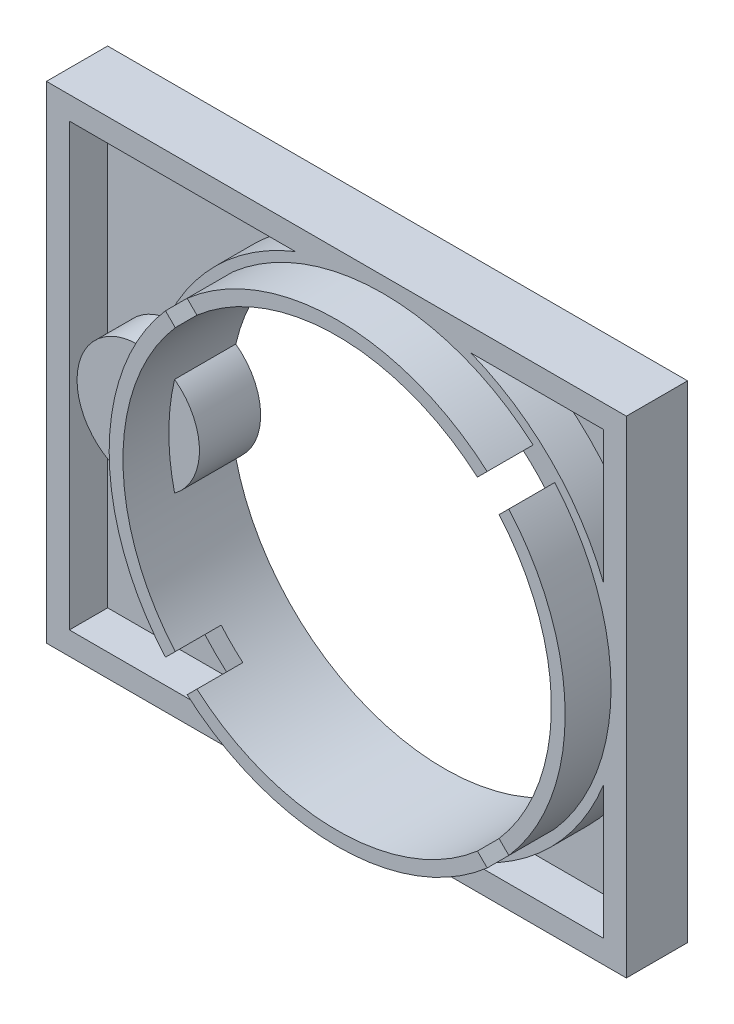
ISO-10303-21;
HEADER;
FILE_DESCRIPTION(('STEP AP214'),'2;1');
FILE_NAME('part.step','',(''),(''),'','','');
FILE_SCHEMA(('AUTOMOTIVE_DESIGN { 1 0 10303 214 1 1 1 1 }'));
ENDSEC;
DATA;
#1=APPLICATION_CONTEXT('core data for automotive mechanical design processes');
#2=APPLICATION_PROTOCOL_DEFINITION('international standard','automotive_design',2000,#1);
#3=PRODUCT_CONTEXT('',#1,'mechanical');
#4=PRODUCT('Part','Part','',(#3));
#5=PRODUCT_RELATED_PRODUCT_CATEGORY('part','',(#4));
#6=PRODUCT_DEFINITION_FORMATION('','',#4);
#7=PRODUCT_DEFINITION_CONTEXT('part definition',#1,'design');
#8=PRODUCT_DEFINITION('design','',#6,#7);
#9=PRODUCT_DEFINITION_SHAPE('','',#8);
#10=(LENGTH_UNIT() NAMED_UNIT(*) SI_UNIT(.MILLI.,.METRE.));
#11=(NAMED_UNIT(*) PLANE_ANGLE_UNIT() SI_UNIT($,.RADIAN.));
#12=(NAMED_UNIT(*) SI_UNIT($,.STERADIAN.) SOLID_ANGLE_UNIT());
#13=UNCERTAINTY_MEASURE_WITH_UNIT(LENGTH_MEASURE(1.E-05),#10,'distance_accuracy_value','');
#14=(GEOMETRIC_REPRESENTATION_CONTEXT(3) GLOBAL_UNCERTAINTY_ASSIGNED_CONTEXT((#13)) GLOBAL_UNIT_ASSIGNED_CONTEXT((#10,
#11,#12)) REPRESENTATION_CONTEXT('',''));
#15=CARTESIAN_POINT('',(0.,0.,0.));
#16=DIRECTION('',(0.,0.,1.));
#17=DIRECTION('',(1.,0.,0.));
#18=AXIS2_PLACEMENT_3D('',#15,#16,#17);
#19=CARTESIAN_POINT('',(0.,0.,3.));
#20=DIRECTION('',(0.,0.,-1.));
#21=DIRECTION('',(-1.,0.,0.));
#22=AXIS2_PLACEMENT_3D('',#19,#20,#21);
#23=CYLINDRICAL_SURFACE('',#22,14.9);
#24=CARTESIAN_POINT('',(0.,0.,0.));
#25=DIRECTION('',(0.,0.,1.));
#26=DIRECTION('',(1.,0.,0.));
#27=AXIS2_PLACEMENT_3D('',#24,#25,#26);
#28=CIRCLE('',#27,14.9);
#29=CARTESIAN_POINT('',(11.2192426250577,-9.80502906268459,0.));
#30=VERTEX_POINT('',#29);
#31=CARTESIAN_POINT('',(11.2192426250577,9.80502906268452,0.));
#32=VERTEX_POINT('',#31);
#33=EDGE_CURVE('E269',#30,#32,#28,.T.);
#34=ORIENTED_EDGE('',*,*,#33,.T.);
#35=DIRECTION('',(0.,0.,-1.));
#36=VECTOR('',#35,1.);
#37=CARTESIAN_POINT('',(11.2192426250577,9.80502906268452,3.));
#38=LINE('',#37,#36);
#39=CARTESIAN_POINT('',(11.2192426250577,9.80502906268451,3.));
#40=VERTEX_POINT('',#39);
#41=EDGE_CURVE('E254',#32,#40,#38,.F.);
#42=ORIENTED_EDGE('',*,*,#41,.T.);
#43=CARTESIAN_POINT('',(0.,0.,3.));
#44=DIRECTION('',(0.,0.,1.));
#45=DIRECTION('',(1.,0.,0.));
#46=AXIS2_PLACEMENT_3D('',#43,#44,#45);
#47=CIRCLE('',#46,14.9);
#48=CARTESIAN_POINT('',(11.2192426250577,-9.80502906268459,3.));
#49=VERTEX_POINT('',#48);
#50=EDGE_CURVE('E694',#49,#40,#47,.T.);
#51=ORIENTED_EDGE('',*,*,#50,.F.);
#52=DIRECTION('',(0.,0.,-1.));
#53=VECTOR('',#52,1.);
#54=CARTESIAN_POINT('',(11.2192426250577,-9.80502906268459,3.));
#55=LINE('',#54,#53);
#56=EDGE_CURVE('E274',#49,#30,#55,.T.);
#57=ORIENTED_EDGE('',*,*,#56,.T.);
#58=EDGE_LOOP('',(#34,#42,#51,#57));
#59=FACE_BOUND('',#58,.T.);
#60=ADVANCED_FACE('F34',(#59),#23,.T.);
#61=CARTESIAN_POINT('',(-9.80502906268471,-11.2192426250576,0.));
#62=VERTEX_POINT('',#61);
#63=CARTESIAN_POINT('',(9.80502906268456,-11.2192426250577,0.));
#64=VERTEX_POINT('',#63);
#65=EDGE_CURVE('E275',#62,#64,#28,.T.);
#66=ORIENTED_EDGE('',*,*,#65,.T.);
#67=DIRECTION('',(0.,0.,-1.));
#68=VECTOR('',#67,1.);
#69=CARTESIAN_POINT('',(9.80502906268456,-11.2192426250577,3.));
#70=LINE('',#69,#68);
#71=CARTESIAN_POINT('',(9.80502906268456,-11.2192426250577,3.));
#72=VERTEX_POINT('',#71);
#73=EDGE_CURVE('E383',#64,#72,#70,.F.);
#74=ORIENTED_EDGE('',*,*,#73,.T.);
#75=CARTESIAN_POINT('',(-9.80502906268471,-11.2192426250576,3.));
#76=VERTEX_POINT('',#75);
#77=EDGE_CURVE('E352',#76,#72,#47,.T.);
#78=ORIENTED_EDGE('',*,*,#77,.F.);
#79=DIRECTION('',(0.,0.,-1.));
#80=VECTOR('',#79,1.);
#81=CARTESIAN_POINT('',(-9.80502906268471,-11.2192426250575,3.));
#82=LINE('',#81,#80);
#83=EDGE_CURVE('E376',#76,#62,#82,.T.);
#84=ORIENTED_EDGE('',*,*,#83,.T.);
#85=EDGE_LOOP('',(#66,#74,#78,#84));
#86=FACE_BOUND('',#85,.T.);
#87=ADVANCED_FACE('F555',(#86),#23,.T.);
#88=CARTESIAN_POINT('',(-11.2192426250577,9.80502906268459,0.));
#89=VERTEX_POINT('',#88);
#90=CARTESIAN_POINT('',(-11.2192426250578,-9.80502906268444,0.));
#91=VERTEX_POINT('',#90);
#92=EDGE_CURVE('E279',#89,#91,#28,.T.);
#93=ORIENTED_EDGE('',*,*,#92,.T.);
#94=DIRECTION('',(0.,0.,-1.));
#95=VECTOR('',#94,1.);
#96=CARTESIAN_POINT('',(-11.2192426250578,-9.80502906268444,3.));
#97=LINE('',#96,#95);
#98=CARTESIAN_POINT('',(-11.2192426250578,-9.80502906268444,3.));
#99=VERTEX_POINT('',#98);
#100=EDGE_CURVE('E379',#91,#99,#97,.F.);
#101=ORIENTED_EDGE('',*,*,#100,.T.);
#102=CARTESIAN_POINT('',(-11.2192426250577,9.80502906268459,3.));
#103=VERTEX_POINT('',#102);
#104=EDGE_CURVE('E285',#103,#99,#47,.T.);
#105=ORIENTED_EDGE('',*,*,#104,.F.);
#106=DIRECTION('',(0.,0.,-1.));
#107=VECTOR('',#106,1.);
#108=CARTESIAN_POINT('',(-11.2192426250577,9.80502906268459,3.));
#109=LINE('',#108,#107);
#110=EDGE_CURVE('E396',#103,#89,#109,.T.);
#111=ORIENTED_EDGE('',*,*,#110,.T.);
#112=EDGE_LOOP('',(#93,#101,#105,#111));
#113=FACE_BOUND('',#112,.T.);
#114=ADVANCED_FACE('F546',(#113),#23,.T.);
#115=CARTESIAN_POINT('',(0.,0.,3.));
#116=DIRECTION('',(0.,0.,1.));
#117=DIRECTION('',(1.,0.,0.));
#118=AXIS2_PLACEMENT_3D('',#115,#116,#117);
#119=PLANE('',#118);
#120=DIRECTION('',(0.707106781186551,0.707106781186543,0.));
#121=VECTOR('',#120,1.);
#122=CARTESIAN_POINT('',(9.19238815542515,7.77817459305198,3.));
#123=LINE('',#122,#121);
#124=CARTESIAN_POINT('',(10.5813156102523,9.16710204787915,3.));
#125=VERTEX_POINT('',#124);
#126=EDGE_CURVE('E259',#125,#40,#123,.T.);
#127=ORIENTED_EDGE('',*,*,#126,.F.);
#128=CARTESIAN_POINT('',(0.,0.,3.));
#129=DIRECTION('',(0.,0.,1.));
#130=DIRECTION('',(1.,0.,0.));
#131=AXIS2_PLACEMENT_3D('',#128,#129,#130);
#132=CIRCLE('',#131,14.);
#133=CARTESIAN_POINT('',(10.5813156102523,-9.16710204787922,3.));
#134=VERTEX_POINT('',#133);
#135=EDGE_CURVE('E328',#134,#125,#132,.T.);
#136=ORIENTED_EDGE('',*,*,#135,.F.);
#137=DIRECTION('',(-0.707106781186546,0.707106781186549,0.));
#138=VECTOR('',#137,1.);
#139=CARTESIAN_POINT('',(12.7279220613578,-11.3137084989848,3.));
#140=LINE('',#139,#138);
#141=EDGE_CURVE('E356',#49,#134,#140,.T.);
#142=ORIENTED_EDGE('',*,*,#141,.F.);
#143=ORIENTED_EDGE('',*,*,#50,.T.);
#144=EDGE_LOOP('',(#127,#136,#142,#143));
#145=FACE_BOUND('',#144,.T.);
#146=ADVANCED_FACE('F563',(#145),#119,.T.);
#147=DIRECTION('',(0.707106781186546,-0.707106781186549,0.));
#148=VECTOR('',#147,1.);
#149=CARTESIAN_POINT('',(7.77817459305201,-9.19238815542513,3.));
#150=LINE('',#149,#148);
#151=CARTESIAN_POINT('',(9.16710204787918,-10.5813156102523,3.));
#152=VERTEX_POINT('',#151);
#153=EDGE_CURVE('E351',#152,#72,#150,.T.);
#154=ORIENTED_EDGE('',*,*,#153,.F.);
#155=CARTESIAN_POINT('',(-9.16710204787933,-10.5813156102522,3.));
#156=VERTEX_POINT('',#155);
#157=EDGE_CURVE('E331',#156,#152,#132,.T.);
#158=ORIENTED_EDGE('',*,*,#157,.F.);
#159=DIRECTION('',(0.707106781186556,0.707106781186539,0.));
#160=VECTOR('',#159,1.);
#161=CARTESIAN_POINT('',(-11.3137084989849,-12.7279220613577,3.));
#162=LINE('',#161,#160);
#163=EDGE_CURVE('E349',#76,#156,#162,.T.);
#164=ORIENTED_EDGE('',*,*,#163,.F.);
#165=ORIENTED_EDGE('',*,*,#77,.T.);
#166=EDGE_LOOP('',(#154,#158,#164,#165));
#167=FACE_BOUND('',#166,.T.);
#168=ADVANCED_FACE('F347',(#167),#119,.T.);
#169=DIRECTION('',(-0.707106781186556,-0.707106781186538,0.));
#170=VECTOR('',#169,1.);
#171=CARTESIAN_POINT('',(-9.19238815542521,-7.77817459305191,3.));
#172=LINE('',#171,#170);
#173=CARTESIAN_POINT('',(-10.5813156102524,-9.16710204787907,3.));
#174=VERTEX_POINT('',#173);
#175=EDGE_CURVE('E367',#174,#99,#172,.T.);
#176=ORIENTED_EDGE('',*,*,#175,.F.);
#177=CARTESIAN_POINT('',(-10.5813156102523,9.16710204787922,3.));
#178=VERTEX_POINT('',#177);
#179=EDGE_CURVE('E330',#178,#174,#132,.T.);
#180=ORIENTED_EDGE('',*,*,#179,.F.);
#181=DIRECTION('',(0.707106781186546,-0.707106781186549,0.));
#182=VECTOR('',#181,1.);
#183=CARTESIAN_POINT('',(-12.7279220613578,11.3137084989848,3.));
#184=LINE('',#183,#182);
#185=EDGE_CURVE('E264',#103,#178,#184,.T.);
#186=ORIENTED_EDGE('',*,*,#185,.F.);
#187=ORIENTED_EDGE('',*,*,#104,.T.);
#188=EDGE_LOOP('',(#176,#180,#186,#187));
#189=FACE_BOUND('',#188,.T.);
#190=ADVANCED_FACE('F537',(#189),#119,.T.);
#191=CARTESIAN_POINT('',(0.,0.,0.));
#192=DIRECTION('',(0.,0.,1.));
#193=DIRECTION('',(1.,0.,0.));
#194=AXIS2_PLACEMENT_3D('',#191,#192,#193);
#195=PLANE('',#194);
#196=DIRECTION('',(0.,-1.,0.));
#197=VECTOR('',#196,1.);
#198=CARTESIAN_POINT('',(14.4,0.,0.));
#199=LINE('',#198,#197);
#200=CARTESIAN_POINT('',(14.4,14.4,0.));
#201=VERTEX_POINT('',#200);
#202=CARTESIAN_POINT('',(14.4,5.73498038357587,0.));
#203=VERTEX_POINT('',#202);
#204=EDGE_CURVE('E459',#201,#203,#199,.T.);
#205=ORIENTED_EDGE('',*,*,#204,.T.);
#206=CARTESIAN_POINT('',(0.,0.,0.));
#207=DIRECTION('',(0.,0.,1.));
#208=DIRECTION('',(1.,0.,0.));
#209=AXIS2_PLACEMENT_3D('',#206,#207,#208);
#210=CIRCLE('',#209,15.5);
#211=CARTESIAN_POINT('',(5.73498038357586,14.4,0.));
#212=VERTEX_POINT('',#211);
#213=EDGE_CURVE('E483',#212,#203,#210,.F.);
#214=ORIENTED_EDGE('',*,*,#213,.F.);
#215=DIRECTION('',(1.,0.,0.));
#216=VECTOR('',#215,1.);
#217=CARTESIAN_POINT('',(0.,14.4,0.));
#218=LINE('',#217,#216);
#219=EDGE_CURVE('E466',#212,#201,#218,.T.);
#220=ORIENTED_EDGE('',*,*,#219,.T.);
#221=EDGE_LOOP('',(#205,#214,#220));
#222=FACE_BOUND('',#221,.T.);
#223=DIRECTION('',(-1.,0.,0.));
#224=VECTOR('',#223,1.);
#225=CARTESIAN_POINT('',(0.,-14.4,0.));
#226=LINE('',#225,#224);
#227=CARTESIAN_POINT('',(14.4,-14.4,0.));
#228=VERTEX_POINT('',#227);
#229=CARTESIAN_POINT('',(5.73498038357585,-14.4,0.));
#230=VERTEX_POINT('',#229);
#231=EDGE_CURVE('E455',#228,#230,#226,.T.);
#232=ORIENTED_EDGE('',*,*,#231,.T.);
#233=CARTESIAN_POINT('',(14.4,-5.73498038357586,0.));
#234=VERTEX_POINT('',#233);
#235=EDGE_CURVE('E488',#234,#230,#210,.F.);
#236=ORIENTED_EDGE('',*,*,#235,.F.);
#237=EDGE_CURVE('E462',#234,#228,#199,.T.);
#238=ORIENTED_EDGE('',*,*,#237,.T.);
#239=EDGE_LOOP('',(#232,#236,#238));
#240=FACE_BOUND('',#239,.T.);
#241=CARTESIAN_POINT('',(-16.,0.,0.));
#242=DIRECTION('',(0.,0.,1.));
#243=DIRECTION('',(1.,0.,0.));
#244=AXIS2_PLACEMENT_3D('',#241,#242,#243);
#245=CIRCLE('',#244,4.);
#246=CARTESIAN_POINT('',(-15.0078125,-3.87499212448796,0.));
#247=VERTEX_POINT('',#246);
#248=CARTESIAN_POINT('',(-15.0078125,3.87499212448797,0.));
#249=VERTEX_POINT('',#248);
#250=EDGE_CURVE('E407',#247,#249,#245,.F.);
#251=ORIENTED_EDGE('',*,*,#250,.F.);
#252=CARTESIAN_POINT('',(-5.73498038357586,-14.4,0.));
#253=VERTEX_POINT('',#252);
#254=EDGE_CURVE('E486',#253,#247,#210,.F.);
#255=ORIENTED_EDGE('',*,*,#254,.F.);
#256=CARTESIAN_POINT('',(-20.5,-14.4,0.));
#257=VERTEX_POINT('',#256);
#258=EDGE_CURVE('E427',#253,#257,#226,.T.);
#259=ORIENTED_EDGE('',*,*,#258,.T.);
#260=DIRECTION('',(0.,1.,0.));
#261=VECTOR('',#260,1.);
#262=CARTESIAN_POINT('',(-20.5,0.,0.));
#263=LINE('',#262,#261);
#264=CARTESIAN_POINT('',(-20.5,14.4,0.));
#265=VERTEX_POINT('',#264);
#266=EDGE_CURVE('E458',#257,#265,#263,.T.);
#267=ORIENTED_EDGE('',*,*,#266,.T.);
#268=CARTESIAN_POINT('',(-5.73498038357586,14.4,0.));
#269=VERTEX_POINT('',#268);
#270=EDGE_CURVE('E463',#265,#269,#218,.T.);
#271=ORIENTED_EDGE('',*,*,#270,.T.);
#272=EDGE_CURVE('E485',#249,#269,#210,.F.);
#273=ORIENTED_EDGE('',*,*,#272,.F.);
#274=EDGE_LOOP('',(#251,#255,#259,#267,#271,#273));
#275=FACE_BOUND('',#274,.T.);
#276=DIRECTION('',(-0.707106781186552,-0.707106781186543,0.));
#277=VECTOR('',#276,1.);
#278=CARTESIAN_POINT('',(9.19238815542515,7.77817459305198,0.));
#279=LINE('',#278,#277);
#280=CARTESIAN_POINT('',(10.5813156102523,9.16710204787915,0.));
#281=VERTEX_POINT('',#280);
#282=EDGE_CURVE('E257',#32,#281,#279,.T.);
#283=ORIENTED_EDGE('',*,*,#282,.F.);
#284=ORIENTED_EDGE('',*,*,#33,.F.);
#285=DIRECTION('',(0.707106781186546,-0.707106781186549,0.));
#286=VECTOR('',#285,1.);
#287=CARTESIAN_POINT('',(12.7279220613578,-11.3137084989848,0.));
#288=LINE('',#287,#286);
#289=CARTESIAN_POINT('',(10.5813156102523,-9.16710204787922,0.));
#290=VERTEX_POINT('',#289);
#291=EDGE_CURVE('E56',#290,#30,#288,.T.);
#292=ORIENTED_EDGE('',*,*,#291,.F.);
#293=CARTESIAN_POINT('',(0.,0.,0.));
#294=DIRECTION('',(0.,0.,1.));
#295=DIRECTION('',(1.,0.,0.));
#296=AXIS2_PLACEMENT_3D('',#293,#294,#295);
#297=CIRCLE('',#296,14.);
#298=CARTESIAN_POINT('',(9.16710204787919,-10.5813156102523,0.));
#299=VERTEX_POINT('',#298);
#300=EDGE_CURVE('E372',#290,#299,#297,.F.);
#301=ORIENTED_EDGE('',*,*,#300,.T.);
#302=DIRECTION('',(-0.707106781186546,0.707106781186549,0.));
#303=VECTOR('',#302,1.);
#304=CARTESIAN_POINT('',(7.77817459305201,-9.19238815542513,0.));
#305=LINE('',#304,#303);
#306=EDGE_CURVE('E355',#64,#299,#305,.T.);
#307=ORIENTED_EDGE('',*,*,#306,.F.);
#308=ORIENTED_EDGE('',*,*,#65,.F.);
#309=DIRECTION('',(-0.707106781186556,-0.707106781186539,0.));
#310=VECTOR('',#309,1.);
#311=CARTESIAN_POINT('',(-11.3137084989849,-12.7279220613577,0.));
#312=LINE('',#311,#310);
#313=CARTESIAN_POINT('',(-9.16710204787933,-10.5813156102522,0.));
#314=VERTEX_POINT('',#313);
#315=EDGE_CURVE('E360',#314,#62,#312,.T.);
#316=ORIENTED_EDGE('',*,*,#315,.F.);
#317=CARTESIAN_POINT('',(0.,0.,0.));
#318=DIRECTION('',(0.,0.,1.));
#319=DIRECTION('',(1.,0.,0.));
#320=AXIS2_PLACEMENT_3D('',#317,#318,#319);
#321=CIRCLE('',#320,14.);
#322=CARTESIAN_POINT('',(-10.5813156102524,-9.16710204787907,0.));
#323=VERTEX_POINT('',#322);
#324=EDGE_CURVE('E374',#314,#323,#321,.F.);
#325=ORIENTED_EDGE('',*,*,#324,.T.);
#326=DIRECTION('',(0.707106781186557,0.707106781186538,0.));
#327=VECTOR('',#326,1.);
#328=CARTESIAN_POINT('',(-9.19238815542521,-7.77817459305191,0.));
#329=LINE('',#328,#327);
#330=EDGE_CURVE('E364',#91,#323,#329,.T.);
#331=ORIENTED_EDGE('',*,*,#330,.F.);
#332=ORIENTED_EDGE('',*,*,#92,.F.);
#333=DIRECTION('',(-0.707106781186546,0.707106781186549,0.));
#334=VECTOR('',#333,1.);
#335=CARTESIAN_POINT('',(-12.7279220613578,11.3137084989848,0.));
#336=LINE('',#335,#334);
#337=CARTESIAN_POINT('',(-10.5813156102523,9.16710204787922,0.));
#338=VERTEX_POINT('',#337);
#339=EDGE_CURVE('E390',#338,#89,#336,.T.);
#340=ORIENTED_EDGE('',*,*,#339,.F.);
#341=CARTESIAN_POINT('',(0.,0.,0.));
#342=DIRECTION('',(0.,0.,1.));
#343=DIRECTION('',(1.,0.,0.));
#344=AXIS2_PLACEMENT_3D('',#341,#342,#343);
#345=CIRCLE('',#344,14.);
#346=CARTESIAN_POINT('',(-9.16710204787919,10.5813156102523,0.));
#347=VERTEX_POINT('',#346);
#348=EDGE_CURVE('E394',#338,#347,#345,.F.);
#349=ORIENTED_EDGE('',*,*,#348,.T.);
#350=DIRECTION('',(0.707106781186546,-0.707106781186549,0.));
#351=VECTOR('',#350,1.);
#352=CARTESIAN_POINT('',(-7.77817459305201,9.19238815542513,0.));
#353=LINE('',#352,#351);
#354=CARTESIAN_POINT('',(-9.80502906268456,11.2192426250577,0.));
#355=VERTEX_POINT('',#354);
#356=EDGE_CURVE('E387',#355,#347,#353,.T.);
#357=ORIENTED_EDGE('',*,*,#356,.F.);
#358=CARTESIAN_POINT('',(9.80502906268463,11.2192426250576,0.));
#359=VERTEX_POINT('',#358);
#360=EDGE_CURVE('E276',#359,#355,#28,.T.);
#361=ORIENTED_EDGE('',*,*,#360,.F.);
#362=DIRECTION('',(0.707106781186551,0.707106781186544,0.));
#363=VECTOR('',#362,1.);
#364=CARTESIAN_POINT('',(11.3137084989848,12.7279220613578,0.));
#365=LINE('',#364,#363);
#366=CARTESIAN_POINT('',(9.16710204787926,10.5813156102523,0.));
#367=VERTEX_POINT('',#366);
#368=EDGE_CURVE('E49',#367,#359,#365,.T.);
#369=ORIENTED_EDGE('',*,*,#368,.F.);
#370=CARTESIAN_POINT('',(0.,0.,0.));
#371=DIRECTION('',(0.,0.,1.));
#372=DIRECTION('',(1.,0.,0.));
#373=AXIS2_PLACEMENT_3D('',#370,#371,#372);
#374=CIRCLE('',#373,14.);
#375=EDGE_CURVE('E271',#367,#281,#374,.F.);
#376=ORIENTED_EDGE('',*,*,#375,.T.);
#377=EDGE_LOOP('',(#283,#284,#292,#301,#307,#308,#316,#325,#331,#332,#340,#349,#357,#361,#369,#376));
#378=FACE_BOUND('',#377,.T.);
#379=DIRECTION('',(-1.,0.,0.));
#380=VECTOR('',#379,1.);
#381=CARTESIAN_POINT('',(-22.,-15.9,0.));
#382=LINE('',#381,#380);
#383=CARTESIAN_POINT('',(15.9,-15.9,0.));
#384=VERTEX_POINT('',#383);
#385=CARTESIAN_POINT('',(-22.,-15.9,0.));
#386=VERTEX_POINT('',#385);
#387=EDGE_CURVE('E338',#384,#386,#382,.T.);
#388=ORIENTED_EDGE('',*,*,#387,.F.);
#389=DIRECTION('',(0.,-1.,0.));
#390=VECTOR('',#389,1.);
#391=CARTESIAN_POINT('',(15.9,-15.9,0.));
#392=LINE('',#391,#390);
#393=CARTESIAN_POINT('',(15.9,15.9,0.));
#394=VERTEX_POINT('',#393);
#395=EDGE_CURVE('E645',#394,#384,#392,.T.);
#396=ORIENTED_EDGE('',*,*,#395,.F.);
#397=DIRECTION('',(1.,0.,0.));
#398=VECTOR('',#397,1.);
#399=CARTESIAN_POINT('',(15.9,15.9,0.));
#400=LINE('',#399,#398);
#401=CARTESIAN_POINT('',(-22.,15.9,0.));
#402=VERTEX_POINT('',#401);
#403=EDGE_CURVE('E661',#402,#394,#400,.T.);
#404=ORIENTED_EDGE('',*,*,#403,.F.);
#405=DIRECTION('',(0.,1.,0.));
#406=VECTOR('',#405,1.);
#407=CARTESIAN_POINT('',(-22.,15.9,0.));
#408=LINE('',#407,#406);
#409=EDGE_CURVE('E663',#386,#402,#408,.T.);
#410=ORIENTED_EDGE('',*,*,#409,.F.);
#411=EDGE_LOOP('',(#388,#396,#404,#410));
#412=FACE_BOUND('',#411,.T.);
#413=CARTESIAN_POINT('',(-16.,0.,0.));
#414=DIRECTION('',(0.,0.,1.));
#415=DIRECTION('',(1.,0.,0.));
#416=AXIS2_PLACEMENT_3D('',#413,#414,#415);
#417=CIRCLE('',#416,0.750000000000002);
#418=CARTESIAN_POINT('',(-15.25,0.,0.));
#419=VERTEX_POINT('',#418);
#420=EDGE_CURVE('E287',#419,#419,#417,.T.);
#421=ORIENTED_EDGE('',*,*,#420,.F.);
#422=EDGE_LOOP('',(#421));
#423=FACE_BOUND('',#422,.T.);
#424=ADVANCED_FACE('F267',(#222,#240,#275,#378,#412,#423),#195,.T.);
#425=CARTESIAN_POINT('',(9.80502906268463,11.2192426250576,3.));
#426=VERTEX_POINT('',#425);
#427=CARTESIAN_POINT('',(-9.80502906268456,11.2192426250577,3.));
#428=VERTEX_POINT('',#427);
#429=EDGE_CURVE('E284',#426,#428,#47,.T.);
#430=ORIENTED_EDGE('',*,*,#429,.F.);
#431=DIRECTION('',(0.,0.,-1.));
#432=VECTOR('',#431,1.);
#433=CARTESIAN_POINT('',(9.80502906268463,11.2192426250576,3.));
#434=LINE('',#433,#432);
#435=EDGE_CURVE('E265',#426,#359,#434,.T.);
#436=ORIENTED_EDGE('',*,*,#435,.T.);
#437=ORIENTED_EDGE('',*,*,#360,.T.);
#438=DIRECTION('',(0.,0.,-1.));
#439=VECTOR('',#438,1.);
#440=CARTESIAN_POINT('',(-9.80502906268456,11.2192426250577,3.));
#441=LINE('',#440,#439);
#442=EDGE_CURVE('E399',#355,#428,#441,.F.);
#443=ORIENTED_EDGE('',*,*,#442,.T.);
#444=EDGE_LOOP('',(#430,#436,#437,#443));
#445=FACE_BOUND('',#444,.T.);
#446=ADVANCED_FACE('F36',(#445),#23,.T.);
#447=DIRECTION('',(-0.707106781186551,-0.707106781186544,0.));
#448=VECTOR('',#447,1.);
#449=CARTESIAN_POINT('',(11.3137084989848,12.7279220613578,3.));
#450=LINE('',#449,#448);
#451=CARTESIAN_POINT('',(9.16710204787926,10.5813156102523,3.));
#452=VERTEX_POINT('',#451);
#453=EDGE_CURVE('E324',#426,#452,#450,.T.);
#454=ORIENTED_EDGE('',*,*,#453,.F.);
#455=ORIENTED_EDGE('',*,*,#429,.T.);
#456=DIRECTION('',(-0.707106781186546,0.707106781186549,0.));
#457=VECTOR('',#456,1.);
#458=CARTESIAN_POINT('',(-7.77817459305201,9.19238815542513,3.));
#459=LINE('',#458,#457);
#460=CARTESIAN_POINT('',(-9.16710204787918,10.5813156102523,3.));
#461=VERTEX_POINT('',#460);
#462=EDGE_CURVE('E327',#461,#428,#459,.T.);
#463=ORIENTED_EDGE('',*,*,#462,.F.);
#464=EDGE_CURVE('E290',#452,#461,#132,.T.);
#465=ORIENTED_EDGE('',*,*,#464,.F.);
#466=EDGE_LOOP('',(#454,#455,#463,#465));
#467=FACE_BOUND('',#466,.T.);
#468=ADVANCED_FACE('F323',(#467),#119,.T.);
#469=CARTESIAN_POINT('',(-22.,-15.9,-4.));
#470=DIRECTION('',(0.,1.,0.));
#471=DIRECTION('',(-1.,0.,0.));
#472=AXIS2_PLACEMENT_3D('',#469,#470,#471);
#473=PLANE('',#472);
#474=ORIENTED_EDGE('',*,*,#387,.T.);
#475=DIRECTION('',(0.,0.,1.));
#476=VECTOR('',#475,1.);
#477=CARTESIAN_POINT('',(-22.,-15.9,-4.));
#478=LINE('',#477,#476);
#479=CARTESIAN_POINT('',(-22.,-15.9,-4.));
#480=VERTEX_POINT('',#479);
#481=EDGE_CURVE('E280',#480,#386,#478,.T.);
#482=ORIENTED_EDGE('',*,*,#481,.F.);
#483=DIRECTION('',(-1.,0.,0.));
#484=VECTOR('',#483,1.);
#485=CARTESIAN_POINT('',(-22.,-15.9,-4.));
#486=LINE('',#485,#484);
#487=CARTESIAN_POINT('',(15.9,-15.9,-4.));
#488=VERTEX_POINT('',#487);
#489=EDGE_CURVE('E636',#488,#480,#486,.T.);
#490=ORIENTED_EDGE('',*,*,#489,.F.);
#491=DIRECTION('',(0.,0.,1.));
#492=VECTOR('',#491,1.);
#493=CARTESIAN_POINT('',(15.9,-15.9,-4.));
#494=LINE('',#493,#492);
#495=EDGE_CURVE('E658',#488,#384,#494,.T.);
#496=ORIENTED_EDGE('',*,*,#495,.T.);
#497=EDGE_LOOP('',(#474,#482,#490,#496));
#498=FACE_BOUND('',#497,.T.);
#499=ADVANCED_FACE('F648',(#498),#473,.F.);
#500=CARTESIAN_POINT('',(-22.,15.9,-4.));
#501=DIRECTION('',(1.,0.,0.));
#502=DIRECTION('',(0.,1.,0.));
#503=AXIS2_PLACEMENT_3D('',#500,#501,#502);
#504=PLANE('',#503);
#505=ORIENTED_EDGE('',*,*,#409,.T.);
#506=DIRECTION('',(0.,0.,1.));
#507=VECTOR('',#506,1.);
#508=CARTESIAN_POINT('',(-22.,15.9,-4.));
#509=LINE('',#508,#507);
#510=CARTESIAN_POINT('',(-22.,15.9,-4.));
#511=VERTEX_POINT('',#510);
#512=EDGE_CURVE('E651',#511,#402,#509,.T.);
#513=ORIENTED_EDGE('',*,*,#512,.F.);
#514=DIRECTION('',(0.,1.,0.));
#515=VECTOR('',#514,1.);
#516=CARTESIAN_POINT('',(-22.,15.9,-4.));
#517=LINE('',#516,#515);
#518=EDGE_CURVE('E638',#480,#511,#517,.T.);
#519=ORIENTED_EDGE('',*,*,#518,.F.);
#520=ORIENTED_EDGE('',*,*,#481,.T.);
#521=EDGE_LOOP('',(#505,#513,#519,#520));
#522=FACE_BOUND('',#521,.T.);
#523=ADVANCED_FACE('F675',(#522),#504,.F.);
#524=CARTESIAN_POINT('',(15.9,15.9,-4.));
#525=DIRECTION('',(0.,-1.,0.));
#526=DIRECTION('',(0.,0.,-1.));
#527=AXIS2_PLACEMENT_3D('',#524,#525,#526);
#528=PLANE('',#527);
#529=ORIENTED_EDGE('',*,*,#403,.T.);
#530=DIRECTION('',(0.,0.,1.));
#531=VECTOR('',#530,1.);
#532=CARTESIAN_POINT('',(15.9,15.9,-4.));
#533=LINE('',#532,#531);
#534=CARTESIAN_POINT('',(15.9,15.9,-4.));
#535=VERTEX_POINT('',#534);
#536=EDGE_CURVE('E653',#535,#394,#533,.T.);
#537=ORIENTED_EDGE('',*,*,#536,.F.);
#538=DIRECTION('',(1.,0.,0.));
#539=VECTOR('',#538,1.);
#540=CARTESIAN_POINT('',(15.9,15.9,-4.));
#541=LINE('',#540,#539);
#542=EDGE_CURVE('E667',#511,#535,#541,.T.);
#543=ORIENTED_EDGE('',*,*,#542,.F.);
#544=ORIENTED_EDGE('',*,*,#512,.T.);
#545=EDGE_LOOP('',(#529,#537,#543,#544));
#546=FACE_BOUND('',#545,.T.);
#547=ADVANCED_FACE('F629',(#546),#528,.F.);
#548=CARTESIAN_POINT('',(15.9,-15.9,-4.));
#549=DIRECTION('',(-1.,0.,0.));
#550=DIRECTION('',(0.,-1.,0.));
#551=AXIS2_PLACEMENT_3D('',#548,#549,#550);
#552=PLANE('',#551);
#553=ORIENTED_EDGE('',*,*,#395,.T.);
#554=ORIENTED_EDGE('',*,*,#495,.F.);
#555=DIRECTION('',(0.,-1.,0.));
#556=VECTOR('',#555,1.);
#557=CARTESIAN_POINT('',(15.9,-15.9,-4.));
#558=LINE('',#557,#556);
#559=EDGE_CURVE('E641',#535,#488,#558,.T.);
#560=ORIENTED_EDGE('',*,*,#559,.F.);
#561=ORIENTED_EDGE('',*,*,#536,.T.);
#562=EDGE_LOOP('',(#553,#554,#560,#561));
#563=FACE_BOUND('',#562,.T.);
#564=ADVANCED_FACE('F624',(#563),#552,.F.);
#565=CARTESIAN_POINT('',(0.,0.,-4.));
#566=DIRECTION('',(0.,0.,1.));
#567=DIRECTION('',(1.,0.,0.));
#568=AXIS2_PLACEMENT_3D('',#565,#566,#567);
#569=PLANE('',#568);
#570=CARTESIAN_POINT('',(0.,0.,-4.));
#571=DIRECTION('',(0.,0.,1.));
#572=DIRECTION('',(1.,0.,0.));
#573=AXIS2_PLACEMENT_3D('',#570,#571,#572);
#574=CIRCLE('',#573,14.);
#575=CARTESIAN_POINT('',(-13.625,-3.21859829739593,-4.));
#576=VERTEX_POINT('',#575);
#577=CARTESIAN_POINT('',(-13.625,3.21859829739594,-4.));
#578=VERTEX_POINT('',#577);
#579=EDGE_CURVE('E335',#576,#578,#574,.T.);
#580=ORIENTED_EDGE('',*,*,#579,.T.);
#581=CARTESIAN_POINT('',(-16.,0.,-4.));
#582=DIRECTION('',(0.,0.,-1.));
#583=DIRECTION('',(-1.,0.,0.));
#584=AXIS2_PLACEMENT_3D('',#581,#582,#583);
#585=CIRCLE('',#584,4.);
#586=EDGE_CURVE('E403',#578,#576,#585,.T.);
#587=ORIENTED_EDGE('',*,*,#586,.T.);
#588=EDGE_LOOP('',(#580,#587));
#589=FACE_BOUND('',#588,.T.);
#590=ORIENTED_EDGE('',*,*,#489,.T.);
#591=ORIENTED_EDGE('',*,*,#518,.T.);
#592=ORIENTED_EDGE('',*,*,#542,.T.);
#593=ORIENTED_EDGE('',*,*,#559,.T.);
#594=EDGE_LOOP('',(#590,#591,#592,#593));
#595=FACE_BOUND('',#594,.T.);
#596=CARTESIAN_POINT('',(-16.,0.,-4.));
#597=DIRECTION('',(0.,0.,-1.));
#598=DIRECTION('',(-1.,0.,0.));
#599=AXIS2_PLACEMENT_3D('',#596,#597,#598);
#600=CIRCLE('',#599,0.750000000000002);
#601=CARTESIAN_POINT('',(-16.75,0.,-4.));
#602=VERTEX_POINT('',#601);
#603=EDGE_CURVE('E291',#602,#602,#600,.T.);
#604=ORIENTED_EDGE('',*,*,#603,.F.);
#605=EDGE_LOOP('',(#604));
#606=FACE_BOUND('',#605,.T.);
#607=ADVANCED_FACE('F622',(#589,#595,#606),#569,.F.);
#608=CARTESIAN_POINT('',(0.,0.,-4.));
#609=DIRECTION('',(0.,0.,1.));
#610=DIRECTION('',(1.,0.,0.));
#611=AXIS2_PLACEMENT_3D('',#608,#609,#610);
#612=CYLINDRICAL_SURFACE('',#611,14.);
#613=ORIENTED_EDGE('',*,*,#135,.T.);
#614=DIRECTION('',(0.,0.,1.));
#615=VECTOR('',#614,1.);
#616=CARTESIAN_POINT('',(10.5813156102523,9.16710204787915,-4.));
#617=LINE('',#616,#615);
#618=EDGE_CURVE('E11',#125,#281,#617,.F.);
#619=ORIENTED_EDGE('',*,*,#618,.T.);
#620=ORIENTED_EDGE('',*,*,#375,.F.);
#621=DIRECTION('',(0.,0.,1.));
#622=VECTOR('',#621,1.);
#623=CARTESIAN_POINT('',(9.16710204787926,10.5813156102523,-4.));
#624=LINE('',#623,#622);
#625=EDGE_CURVE('E42',#367,#452,#624,.T.);
#626=ORIENTED_EDGE('',*,*,#625,.T.);
#627=ORIENTED_EDGE('',*,*,#464,.T.);
#628=DIRECTION('',(0.,0.,1.));
#629=VECTOR('',#628,1.);
#630=CARTESIAN_POINT('',(-9.16710204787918,10.5813156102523,-4.));
#631=LINE('',#630,#629);
#632=EDGE_CURVE('E298',#461,#347,#631,.F.);
#633=ORIENTED_EDGE('',*,*,#632,.T.);
#634=ORIENTED_EDGE('',*,*,#348,.F.);
#635=DIRECTION('',(0.,0.,1.));
#636=VECTOR('',#635,1.);
#637=CARTESIAN_POINT('',(-10.5813156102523,9.16710204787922,-4.));
#638=LINE('',#637,#636);
#639=EDGE_CURVE('E295',#338,#178,#638,.T.);
#640=ORIENTED_EDGE('',*,*,#639,.T.);
#641=ORIENTED_EDGE('',*,*,#179,.T.);
#642=DIRECTION('',(0.,0.,1.));
#643=VECTOR('',#642,1.);
#644=CARTESIAN_POINT('',(-10.5813156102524,-9.16710204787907,-4.));
#645=LINE('',#644,#643);
#646=EDGE_CURVE('E304',#174,#323,#645,.F.);
#647=ORIENTED_EDGE('',*,*,#646,.T.);
#648=ORIENTED_EDGE('',*,*,#324,.F.);
#649=DIRECTION('',(0.,0.,1.));
#650=VECTOR('',#649,1.);
#651=CARTESIAN_POINT('',(-9.16710204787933,-10.5813156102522,-4.));
#652=LINE('',#651,#650);
#653=EDGE_CURVE('E301',#314,#156,#652,.T.);
#654=ORIENTED_EDGE('',*,*,#653,.T.);
#655=ORIENTED_EDGE('',*,*,#157,.T.);
#656=DIRECTION('',(0.,0.,1.));
#657=VECTOR('',#656,1.);
#658=CARTESIAN_POINT('',(9.16710204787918,-10.5813156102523,-4.));
#659=LINE('',#658,#657);
#660=EDGE_CURVE('E310',#152,#299,#659,.F.);
#661=ORIENTED_EDGE('',*,*,#660,.T.);
#662=ORIENTED_EDGE('',*,*,#300,.F.);
#663=DIRECTION('',(0.,0.,1.));
#664=VECTOR('',#663,1.);
#665=CARTESIAN_POINT('',(10.5813156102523,-9.16710204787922,-4.));
#666=LINE('',#665,#664);
#667=EDGE_CURVE('E307',#290,#134,#666,.T.);
#668=ORIENTED_EDGE('',*,*,#667,.T.);
#669=EDGE_LOOP('',(#613,#619,#620,#626,#627,#633,#634,#640,#641,#647,#648,#654,#655,#661,#662,#668));
#670=FACE_BOUND('',#669,.T.);
#671=ORIENTED_EDGE('',*,*,#579,.F.);
#672=DIRECTION('',(0.,0.,-1.));
#673=VECTOR('',#672,1.);
#674=CARTESIAN_POINT('',(-13.625,-3.21859829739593,-2.));
#675=LINE('',#674,#673);
#676=CARTESIAN_POINT('',(-13.625,-3.21859829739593,0.));
#677=VERTEX_POINT('',#676);
#678=EDGE_CURVE('E421',#576,#677,#675,.F.);
#679=ORIENTED_EDGE('',*,*,#678,.T.);
#680=CARTESIAN_POINT('',(0.,0.,0.));
#681=DIRECTION('',(0.,0.,1.));
#682=DIRECTION('',(1.,0.,0.));
#683=AXIS2_PLACEMENT_3D('',#680,#681,#682);
#684=CIRCLE('',#683,14.);
#685=CARTESIAN_POINT('',(-13.625,3.21859829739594,0.));
#686=VERTEX_POINT('',#685);
#687=EDGE_CURVE('E406',#677,#686,#684,.F.);
#688=ORIENTED_EDGE('',*,*,#687,.T.);
#689=DIRECTION('',(0.,0.,-1.));
#690=VECTOR('',#689,1.);
#691=CARTESIAN_POINT('',(-13.625,3.21859829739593,-2.));
#692=LINE('',#691,#690);
#693=EDGE_CURVE('E418',#686,#578,#692,.T.);
#694=ORIENTED_EDGE('',*,*,#693,.T.);
#695=EDGE_LOOP('',(#671,#679,#688,#694));
#696=FACE_BOUND('',#695,.T.);
#697=ADVANCED_FACE('F316',(#670,#696),#612,.F.);
#698=CARTESIAN_POINT('',(-16.,0.,3.));
#699=DIRECTION('',(0.,0.,-1.));
#700=DIRECTION('',(-1.,0.,0.));
#701=AXIS2_PLACEMENT_3D('',#698,#699,#700);
#702=CYLINDRICAL_SURFACE('',#701,0.750000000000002);
#703=ORIENTED_EDGE('',*,*,#420,.T.);
#704=EDGE_LOOP('',(#703));
#705=FACE_BOUND('',#704,.T.);
#706=ORIENTED_EDGE('',*,*,#603,.T.);
#707=EDGE_LOOP('',(#706));
#708=FACE_BOUND('',#707,.T.);
#709=ADVANCED_FACE('F604',(#705,#708),#702,.F.);
#710=CARTESIAN_POINT('',(-20.5,15.9,-4.));
#711=DIRECTION('',(1.,0.,0.));
#712=DIRECTION('',(0.,1.,0.));
#713=AXIS2_PLACEMENT_3D('',#710,#711,#712);
#714=PLANE('',#713);
#715=ORIENTED_EDGE('',*,*,#266,.F.);
#716=DIRECTION('',(0.,0.,1.));
#717=VECTOR('',#716,1.);
#718=CARTESIAN_POINT('',(-20.5,-14.4,-4.));
#719=LINE('',#718,#717);
#720=CARTESIAN_POINT('',(-20.5,-14.4,-2.5));
#721=VERTEX_POINT('',#720);
#722=EDGE_CURVE('E445',#721,#257,#719,.T.);
#723=ORIENTED_EDGE('',*,*,#722,.F.);
#724=DIRECTION('',(0.,1.,0.));
#725=VECTOR('',#724,1.);
#726=CARTESIAN_POINT('',(-20.5,0.,-2.5));
#727=LINE('',#726,#725);
#728=CARTESIAN_POINT('',(-20.5,14.4,-2.5));
#729=VERTEX_POINT('',#728);
#730=EDGE_CURVE('E433',#721,#729,#727,.T.);
#731=ORIENTED_EDGE('',*,*,#730,.T.);
#732=DIRECTION('',(0.,0.,1.));
#733=VECTOR('',#732,1.);
#734=CARTESIAN_POINT('',(-20.5,14.4,-4.));
#735=LINE('',#734,#733);
#736=EDGE_CURVE('E449',#729,#265,#735,.T.);
#737=ORIENTED_EDGE('',*,*,#736,.T.);
#738=EDGE_LOOP('',(#715,#723,#731,#737));
#739=FACE_BOUND('',#738,.T.);
#740=ADVANCED_FACE('F510',(#739),#714,.T.);
#741=CARTESIAN_POINT('',(-22.,-14.4,-4.));
#742=DIRECTION('',(0.,1.,0.));
#743=DIRECTION('',(-1.,0.,0.));
#744=AXIS2_PLACEMENT_3D('',#741,#742,#743);
#745=PLANE('',#744);
#746=DIRECTION('',(-1.,0.,0.));
#747=VECTOR('',#746,1.);
#748=CARTESIAN_POINT('',(0.,-14.4,-2.5));
#749=LINE('',#748,#747);
#750=CARTESIAN_POINT('',(-5.73498038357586,-14.4,-2.5));
#751=VERTEX_POINT('',#750);
#752=EDGE_CURVE('E434',#751,#721,#749,.T.);
#753=ORIENTED_EDGE('',*,*,#752,.T.);
#754=ORIENTED_EDGE('',*,*,#722,.T.);
#755=ORIENTED_EDGE('',*,*,#258,.F.);
#756=DIRECTION('',(0.,0.,1.));
#757=VECTOR('',#756,1.);
#758=CARTESIAN_POINT('',(-5.73498038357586,-14.4,-4.));
#759=LINE('',#758,#757);
#760=EDGE_CURVE('E448',#751,#253,#759,.T.);
#761=ORIENTED_EDGE('',*,*,#760,.F.);
#762=EDGE_LOOP('',(#753,#754,#755,#761));
#763=FACE_BOUND('',#762,.T.);
#764=ADVANCED_FACE('F512',(#763),#745,.T.);
#765=CARTESIAN_POINT('',(0.,0.,-2.5));
#766=DIRECTION('',(0.,0.,1.));
#767=DIRECTION('',(1.,0.,0.));
#768=AXIS2_PLACEMENT_3D('',#765,#766,#767);
#769=PLANE('',#768);
#770=CARTESIAN_POINT('',(-16.,0.,-2.5));
#771=DIRECTION('',(0.,0.,1.));
#772=DIRECTION('',(1.,0.,0.));
#773=AXIS2_PLACEMENT_3D('',#770,#771,#772);
#774=CIRCLE('',#773,4.);
#775=CARTESIAN_POINT('',(-15.0078125,3.87499212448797,-2.5));
#776=VERTEX_POINT('',#775);
#777=CARTESIAN_POINT('',(-15.0078125,-3.87499212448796,-2.5));
#778=VERTEX_POINT('',#777);
#779=EDGE_CURVE('E412',#776,#778,#774,.T.);
#780=ORIENTED_EDGE('',*,*,#779,.F.);
#781=CARTESIAN_POINT('',(0.,0.,-2.5));
#782=DIRECTION('',(0.,0.,1.));
#783=DIRECTION('',(1.,0.,0.));
#784=AXIS2_PLACEMENT_3D('',#781,#782,#783);
#785=CIRCLE('',#784,15.5);
#786=CARTESIAN_POINT('',(-5.73498038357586,14.4,-2.5));
#787=VERTEX_POINT('',#786);
#788=EDGE_CURVE('E424',#787,#776,#785,.T.);
#789=ORIENTED_EDGE('',*,*,#788,.F.);
#790=DIRECTION('',(1.,0.,0.));
#791=VECTOR('',#790,1.);
#792=CARTESIAN_POINT('',(0.,14.4,-2.5));
#793=LINE('',#792,#791);
#794=EDGE_CURVE('E437',#729,#787,#793,.T.);
#795=ORIENTED_EDGE('',*,*,#794,.F.);
#796=ORIENTED_EDGE('',*,*,#730,.F.);
#797=ORIENTED_EDGE('',*,*,#752,.F.);
#798=EDGE_CURVE('E425',#778,#751,#785,.T.);
#799=ORIENTED_EDGE('',*,*,#798,.F.);
#800=EDGE_LOOP('',(#780,#789,#795,#796,#797,#799));
#801=FACE_BOUND('',#800,.T.);
#802=ADVANCED_FACE('F518',(#801),#769,.T.);
#803=CARTESIAN_POINT('',(15.9,14.4,-4.));
#804=DIRECTION('',(0.,-1.,0.));
#805=DIRECTION('',(0.,0.,-1.));
#806=AXIS2_PLACEMENT_3D('',#803,#804,#805);
#807=PLANE('',#806);
#808=DIRECTION('',(0.,0.,1.));
#809=VECTOR('',#808,1.);
#810=CARTESIAN_POINT('',(-5.73498038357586,14.4,-4.));
#811=LINE('',#810,#809);
#812=EDGE_CURVE('E475',#787,#269,#811,.T.);
#813=ORIENTED_EDGE('',*,*,#812,.T.);
#814=ORIENTED_EDGE('',*,*,#270,.F.);
#815=ORIENTED_EDGE('',*,*,#736,.F.);
#816=ORIENTED_EDGE('',*,*,#794,.T.);
#817=EDGE_LOOP('',(#813,#814,#815,#816));
#818=FACE_BOUND('',#817,.T.);
#819=ADVANCED_FACE('F502',(#818),#807,.T.);
#820=CARTESIAN_POINT('',(0.,0.,-4.));
#821=DIRECTION('',(0.,0.,1.));
#822=DIRECTION('',(1.,0.,0.));
#823=AXIS2_PLACEMENT_3D('',#820,#821,#822);
#824=CYLINDRICAL_SURFACE('',#823,15.5);
#825=DIRECTION('',(0.,0.,-1.));
#826=VECTOR('',#825,1.);
#827=CARTESIAN_POINT('',(-15.0078125,3.87499212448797,-2.));
#828=LINE('',#827,#826);
#829=EDGE_CURVE('E415',#249,#776,#828,.T.);
#830=ORIENTED_EDGE('',*,*,#829,.F.);
#831=ORIENTED_EDGE('',*,*,#272,.T.);
#832=ORIENTED_EDGE('',*,*,#812,.F.);
#833=ORIENTED_EDGE('',*,*,#788,.T.);
#834=EDGE_LOOP('',(#830,#831,#832,#833));
#835=FACE_BOUND('',#834,.T.);
#836=ADVANCED_FACE('F495',(#835),#824,.T.);
#837=DIRECTION('',(0.,0.,-1.));
#838=VECTOR('',#837,1.);
#839=CARTESIAN_POINT('',(-15.0078125,-3.87499212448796,-2.));
#840=LINE('',#839,#838);
#841=EDGE_CURVE('E292',#778,#247,#840,.F.);
#842=ORIENTED_EDGE('',*,*,#841,.F.);
#843=ORIENTED_EDGE('',*,*,#798,.T.);
#844=ORIENTED_EDGE('',*,*,#760,.T.);
#845=ORIENTED_EDGE('',*,*,#254,.T.);
#846=EDGE_LOOP('',(#842,#843,#844,#845));
#847=FACE_BOUND('',#846,.T.);
#848=ADVANCED_FACE('F614',(#847),#824,.T.);
#849=CARTESIAN_POINT('',(14.4,-14.4,-2.5));
#850=VERTEX_POINT('',#849);
#851=CARTESIAN_POINT('',(5.73498038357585,-14.4,-2.5));
#852=VERTEX_POINT('',#851);
#853=EDGE_CURVE('E430',#850,#852,#749,.T.);
#854=ORIENTED_EDGE('',*,*,#853,.F.);
#855=DIRECTION('',(0.,-1.,0.));
#856=VECTOR('',#855,1.);
#857=CARTESIAN_POINT('',(14.4,0.,-2.5));
#858=LINE('',#857,#856);
#859=CARTESIAN_POINT('',(14.4,-5.73498038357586,-2.5));
#860=VERTEX_POINT('',#859);
#861=EDGE_CURVE('E440',#860,#850,#858,.T.);
#862=ORIENTED_EDGE('',*,*,#861,.F.);
#863=EDGE_CURVE('E428',#852,#860,#785,.T.);
#864=ORIENTED_EDGE('',*,*,#863,.F.);
#865=EDGE_LOOP('',(#854,#862,#864));
#866=FACE_BOUND('',#865,.T.);
#867=ADVANCED_FACE('F527',(#866),#769,.T.);
#868=CARTESIAN_POINT('',(14.4,-15.9,-4.));
#869=DIRECTION('',(-1.,0.,0.));
#870=DIRECTION('',(0.,-1.,0.));
#871=AXIS2_PLACEMENT_3D('',#868,#869,#870);
#872=PLANE('',#871);
#873=ORIENTED_EDGE('',*,*,#861,.T.);
#874=DIRECTION('',(0.,0.,1.));
#875=VECTOR('',#874,1.);
#876=CARTESIAN_POINT('',(14.4,-14.4,-4.));
#877=LINE('',#876,#875);
#878=EDGE_CURVE('E444',#850,#228,#877,.T.);
#879=ORIENTED_EDGE('',*,*,#878,.T.);
#880=ORIENTED_EDGE('',*,*,#237,.F.);
#881=DIRECTION('',(0.,0.,1.));
#882=VECTOR('',#881,1.);
#883=CARTESIAN_POINT('',(14.4,-5.73498038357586,-4.));
#884=LINE('',#883,#882);
#885=EDGE_CURVE('E478',#860,#234,#884,.T.);
#886=ORIENTED_EDGE('',*,*,#885,.F.);
#887=EDGE_LOOP('',(#873,#879,#880,#886));
#888=FACE_BOUND('',#887,.T.);
#889=ADVANCED_FACE('F530',(#888),#872,.T.);
#890=DIRECTION('',(0.,0.,1.));
#891=VECTOR('',#890,1.);
#892=CARTESIAN_POINT('',(5.73498038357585,-14.4,-4.));
#893=LINE('',#892,#891);
#894=EDGE_CURVE('E470',#852,#230,#893,.T.);
#895=ORIENTED_EDGE('',*,*,#894,.T.);
#896=ORIENTED_EDGE('',*,*,#231,.F.);
#897=ORIENTED_EDGE('',*,*,#878,.F.);
#898=ORIENTED_EDGE('',*,*,#853,.T.);
#899=EDGE_LOOP('',(#895,#896,#897,#898));
#900=FACE_BOUND('',#899,.T.);
#901=ADVANCED_FACE('F533',(#900),#745,.T.);
#902=ORIENTED_EDGE('',*,*,#235,.T.);
#903=ORIENTED_EDGE('',*,*,#894,.F.);
#904=ORIENTED_EDGE('',*,*,#863,.T.);
#905=ORIENTED_EDGE('',*,*,#885,.T.);
#906=EDGE_LOOP('',(#902,#903,#904,#905));
#907=FACE_BOUND('',#906,.T.);
#908=ADVANCED_FACE('F523',(#907),#824,.T.);
#909=ORIENTED_EDGE('',*,*,#213,.T.);
#910=DIRECTION('',(0.,0.,1.));
#911=VECTOR('',#910,1.);
#912=CARTESIAN_POINT('',(14.4,5.73498038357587,-4.));
#913=LINE('',#912,#911);
#914=CARTESIAN_POINT('',(14.4,5.73498038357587,-2.5));
#915=VERTEX_POINT('',#914);
#916=EDGE_CURVE('E480',#915,#203,#913,.T.);
#917=ORIENTED_EDGE('',*,*,#916,.F.);
#918=CARTESIAN_POINT('',(5.73498038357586,14.4,-2.5));
#919=VERTEX_POINT('',#918);
#920=EDGE_CURVE('E429',#915,#919,#785,.T.);
#921=ORIENTED_EDGE('',*,*,#920,.T.);
#922=DIRECTION('',(0.,0.,1.));
#923=VECTOR('',#922,1.);
#924=CARTESIAN_POINT('',(5.73498038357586,14.4,-4.));
#925=LINE('',#924,#923);
#926=EDGE_CURVE('E473',#919,#212,#925,.T.);
#927=ORIENTED_EDGE('',*,*,#926,.T.);
#928=EDGE_LOOP('',(#909,#917,#921,#927));
#929=FACE_BOUND('',#928,.T.);
#930=ADVANCED_FACE('F617',(#929),#824,.T.);
#931=ORIENTED_EDGE('',*,*,#916,.T.);
#932=ORIENTED_EDGE('',*,*,#204,.F.);
#933=DIRECTION('',(0.,0.,1.));
#934=VECTOR('',#933,1.);
#935=CARTESIAN_POINT('',(14.4,14.4,-4.));
#936=LINE('',#935,#934);
#937=CARTESIAN_POINT('',(14.4,14.4,-2.5));
#938=VERTEX_POINT('',#937);
#939=EDGE_CURVE('E451',#938,#201,#936,.T.);
#940=ORIENTED_EDGE('',*,*,#939,.F.);
#941=EDGE_CURVE('E441',#938,#915,#858,.T.);
#942=ORIENTED_EDGE('',*,*,#941,.T.);
#943=EDGE_LOOP('',(#931,#932,#940,#942));
#944=FACE_BOUND('',#943,.T.);
#945=ADVANCED_FACE('F611',(#944),#872,.T.);
#946=ORIENTED_EDGE('',*,*,#920,.F.);
#947=ORIENTED_EDGE('',*,*,#941,.F.);
#948=EDGE_CURVE('E436',#919,#938,#793,.T.);
#949=ORIENTED_EDGE('',*,*,#948,.F.);
#950=EDGE_LOOP('',(#946,#947,#949));
#951=FACE_BOUND('',#950,.T.);
#952=ADVANCED_FACE('F607',(#951),#769,.T.);
#953=ORIENTED_EDGE('',*,*,#948,.T.);
#954=ORIENTED_EDGE('',*,*,#939,.T.);
#955=ORIENTED_EDGE('',*,*,#219,.F.);
#956=ORIENTED_EDGE('',*,*,#926,.F.);
#957=EDGE_LOOP('',(#953,#954,#955,#956));
#958=FACE_BOUND('',#957,.T.);
#959=ADVANCED_FACE('F598',(#958),#807,.T.);
#960=CARTESIAN_POINT('',(-16.,0.,11.3137084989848));
#961=DIRECTION('',(0.,0.,-1.));
#962=DIRECTION('',(-1.,0.,0.));
#963=AXIS2_PLACEMENT_3D('',#960,#961,#962);
#964=CYLINDRICAL_SURFACE('',#963,4.);
#965=ORIENTED_EDGE('',*,*,#250,.T.);
#966=ORIENTED_EDGE('',*,*,#829,.T.);
#967=ORIENTED_EDGE('',*,*,#779,.T.);
#968=ORIENTED_EDGE('',*,*,#841,.T.);
#969=EDGE_LOOP('',(#965,#966,#967,#968));
#970=FACE_BOUND('',#969,.T.);
#971=ADVANCED_FACE('F595',(#970),#964,.T.);
#972=ORIENTED_EDGE('',*,*,#678,.F.);
#973=ORIENTED_EDGE('',*,*,#586,.F.);
#974=ORIENTED_EDGE('',*,*,#693,.F.);
#975=EDGE_CURVE('E402',#686,#677,#245,.F.);
#976=ORIENTED_EDGE('',*,*,#975,.T.);
#977=EDGE_LOOP('',(#972,#973,#974,#976));
#978=FACE_BOUND('',#977,.T.);
#979=ADVANCED_FACE('F552',(#978),#964,.T.);
#980=ORIENTED_EDGE('',*,*,#687,.F.);
#981=ORIENTED_EDGE('',*,*,#975,.F.);
#982=EDGE_LOOP('',(#980,#981));
#983=FACE_BOUND('',#982,.T.);
#984=ADVANCED_FACE('F540',(#983),#195,.T.);
#985=CARTESIAN_POINT('',(-7.77817459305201,9.19238815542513,-7.00000000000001));
#986=DIRECTION('',(0.707106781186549,0.707106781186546,0.));
#987=DIRECTION('',(-0.707106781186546,0.707106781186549,0.));
#988=AXIS2_PLACEMENT_3D('',#985,#986,#987);
#989=PLANE('',#988);
#990=ORIENTED_EDGE('',*,*,#356,.T.);
#991=ORIENTED_EDGE('',*,*,#632,.F.);
#992=ORIENTED_EDGE('',*,*,#462,.T.);
#993=ORIENTED_EDGE('',*,*,#442,.F.);
#994=EDGE_LOOP('',(#990,#991,#992,#993));
#995=FACE_BOUND('',#994,.T.);
#996=ADVANCED_FACE('F551',(#995),#989,.F.);
#997=CARTESIAN_POINT('',(-12.7279220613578,11.3137084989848,-7.00000000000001));
#998=DIRECTION('',(-0.707106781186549,-0.707106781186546,0.));
#999=DIRECTION('',(0.707106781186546,-0.707106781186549,0.));
#1000=AXIS2_PLACEMENT_3D('',#997,#998,#999);
#1001=PLANE('',#1000);
#1002=ORIENTED_EDGE('',*,*,#185,.T.);
#1003=ORIENTED_EDGE('',*,*,#639,.F.);
#1004=ORIENTED_EDGE('',*,*,#339,.T.);
#1005=ORIENTED_EDGE('',*,*,#110,.F.);
#1006=EDGE_LOOP('',(#1002,#1003,#1004,#1005));
#1007=FACE_BOUND('',#1006,.T.);
#1008=ADVANCED_FACE('F586',(#1007),#1001,.F.);
#1009=CARTESIAN_POINT('',(-9.19238815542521,-7.77817459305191,-7.00000000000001));
#1010=DIRECTION('',(-0.707106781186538,0.707106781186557,0.));
#1011=DIRECTION('',(-0.707106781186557,-0.707106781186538,0.));
#1012=AXIS2_PLACEMENT_3D('',#1009,#1010,#1011);
#1013=PLANE('',#1012);
#1014=ORIENTED_EDGE('',*,*,#330,.T.);
#1015=ORIENTED_EDGE('',*,*,#646,.F.);
#1016=ORIENTED_EDGE('',*,*,#175,.T.);
#1017=ORIENTED_EDGE('',*,*,#100,.F.);
#1018=EDGE_LOOP('',(#1014,#1015,#1016,#1017));
#1019=FACE_BOUND('',#1018,.T.);
#1020=ADVANCED_FACE('F578',(#1019),#1013,.F.);
#1021=CARTESIAN_POINT('',(-11.3137084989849,-12.7279220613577,-7.00000000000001));
#1022=DIRECTION('',(0.707106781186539,-0.707106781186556,0.));
#1023=DIRECTION('',(0.707106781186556,0.707106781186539,0.));
#1024=AXIS2_PLACEMENT_3D('',#1021,#1022,#1023);
#1025=PLANE('',#1024);
#1026=ORIENTED_EDGE('',*,*,#163,.T.);
#1027=ORIENTED_EDGE('',*,*,#653,.F.);
#1028=ORIENTED_EDGE('',*,*,#315,.T.);
#1029=ORIENTED_EDGE('',*,*,#83,.F.);
#1030=EDGE_LOOP('',(#1026,#1027,#1028,#1029));
#1031=FACE_BOUND('',#1030,.T.);
#1032=ADVANCED_FACE('F570',(#1031),#1025,.F.);
#1033=CARTESIAN_POINT('',(7.77817459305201,-9.19238815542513,-7.00000000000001));
#1034=DIRECTION('',(-0.707106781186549,-0.707106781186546,0.));
#1035=DIRECTION('',(0.707106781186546,-0.707106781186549,0.));
#1036=AXIS2_PLACEMENT_3D('',#1033,#1034,#1035);
#1037=PLANE('',#1036);
#1038=ORIENTED_EDGE('',*,*,#306,.T.);
#1039=ORIENTED_EDGE('',*,*,#660,.F.);
#1040=ORIENTED_EDGE('',*,*,#153,.T.);
#1041=ORIENTED_EDGE('',*,*,#73,.F.);
#1042=EDGE_LOOP('',(#1038,#1039,#1040,#1041));
#1043=FACE_BOUND('',#1042,.T.);
#1044=ADVANCED_FACE('F567',(#1043),#1037,.F.);
#1045=CARTESIAN_POINT('',(12.7279220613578,-11.3137084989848,-7.00000000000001));
#1046=DIRECTION('',(0.707106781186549,0.707106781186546,0.));
#1047=DIRECTION('',(-0.707106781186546,0.707106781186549,0.));
#1048=AXIS2_PLACEMENT_3D('',#1045,#1046,#1047);
#1049=PLANE('',#1048);
#1050=ORIENTED_EDGE('',*,*,#141,.T.);
#1051=ORIENTED_EDGE('',*,*,#667,.F.);
#1052=ORIENTED_EDGE('',*,*,#291,.T.);
#1053=ORIENTED_EDGE('',*,*,#56,.F.);
#1054=EDGE_LOOP('',(#1050,#1051,#1052,#1053));
#1055=FACE_BOUND('',#1054,.T.);
#1056=ADVANCED_FACE('F569',(#1055),#1049,.F.);
#1057=CARTESIAN_POINT('',(9.19238815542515,7.77817459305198,-7.00000000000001));
#1058=DIRECTION('',(0.707106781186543,-0.707106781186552,0.));
#1059=DIRECTION('',(0.707106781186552,0.707106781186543,0.));
#1060=AXIS2_PLACEMENT_3D('',#1057,#1058,#1059);
#1061=PLANE('',#1060);
#1062=ORIENTED_EDGE('',*,*,#282,.T.);
#1063=ORIENTED_EDGE('',*,*,#618,.F.);
#1064=ORIENTED_EDGE('',*,*,#126,.T.);
#1065=ORIENTED_EDGE('',*,*,#41,.F.);
#1066=EDGE_LOOP('',(#1062,#1063,#1064,#1065));
#1067=FACE_BOUND('',#1066,.T.);
#1068=ADVANCED_FACE('F256',(#1067),#1061,.F.);
#1069=CARTESIAN_POINT('',(11.3137084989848,12.7279220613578,-7.00000000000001));
#1070=DIRECTION('',(-0.707106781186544,0.707106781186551,0.));
#1071=DIRECTION('',(-0.707106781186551,-0.707106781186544,0.));
#1072=AXIS2_PLACEMENT_3D('',#1069,#1070,#1071);
#1073=PLANE('',#1072);
#1074=ORIENTED_EDGE('',*,*,#453,.T.);
#1075=ORIENTED_EDGE('',*,*,#625,.F.);
#1076=ORIENTED_EDGE('',*,*,#368,.T.);
#1077=ORIENTED_EDGE('',*,*,#435,.F.);
#1078=EDGE_LOOP('',(#1074,#1075,#1076,#1077));
#1079=FACE_BOUND('',#1078,.T.);
#1080=ADVANCED_FACE('F582',(#1079),#1073,.F.);
#1081=CLOSED_SHELL('',(#60,#87,#114,#146,#168,#190,#424,#446,#468,#499,#523,#547,#564,#607,#697,
#709,#740,#764,#802,#819,#836,#848,#867,#889,#901,#908,#930,#945,#952,#959,#971,#979,#984,#996,
#1008,#1020,#1032,#1044,#1056,#1068,#1080));
#1082=MANIFOLD_SOLID_BREP('B2',#1081);
#1083=ADVANCED_BREP_SHAPE_REPRESENTATION('',(#18,#1082),#14);
#1084=SHAPE_DEFINITION_REPRESENTATION(#9,#1083);
ENDSEC;
END-ISO-10303-21;
